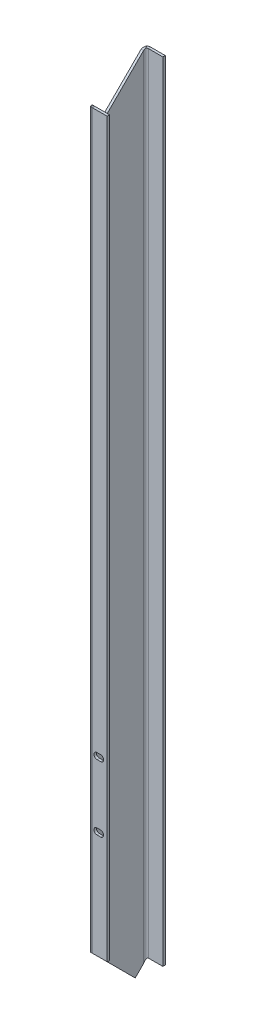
ISO-10303-21;
HEADER;
FILE_DESCRIPTION(('STEP AP214'),'2;1');
FILE_NAME('part.step','',(''),(''),'','','');
FILE_SCHEMA(('AUTOMOTIVE_DESIGN { 1 0 10303 214 1 1 1 1 }'));
ENDSEC;
DATA;
#1=APPLICATION_CONTEXT('core data for automotive mechanical design processes');
#2=APPLICATION_PROTOCOL_DEFINITION('international standard','automotive_design',2000,#1);
#3=PRODUCT_CONTEXT('',#1,'mechanical');
#4=PRODUCT('Part','Part','',(#3));
#5=PRODUCT_RELATED_PRODUCT_CATEGORY('part','',(#4));
#6=PRODUCT_DEFINITION_FORMATION('','',#4);
#7=PRODUCT_DEFINITION_CONTEXT('part definition',#1,'design');
#8=PRODUCT_DEFINITION('design','',#6,#7);
#9=PRODUCT_DEFINITION_SHAPE('','',#8);
#10=(LENGTH_UNIT() NAMED_UNIT(*) SI_UNIT(.MILLI.,.METRE.));
#11=(NAMED_UNIT(*) PLANE_ANGLE_UNIT() SI_UNIT($,.RADIAN.));
#12=(NAMED_UNIT(*) SI_UNIT($,.STERADIAN.) SOLID_ANGLE_UNIT());
#13=UNCERTAINTY_MEASURE_WITH_UNIT(LENGTH_MEASURE(1.E-05),#10,'distance_accuracy_value','');
#14=(GEOMETRIC_REPRESENTATION_CONTEXT(3) GLOBAL_UNCERTAINTY_ASSIGNED_CONTEXT((#13)) GLOBAL_UNIT_ASSIGNED_CONTEXT((#10,
#11,#12)) REPRESENTATION_CONTEXT('',''));
#15=CARTESIAN_POINT('',(0.,0.,0.));
#16=DIRECTION('',(0.,0.,1.));
#17=DIRECTION('',(1.,0.,0.));
#18=AXIS2_PLACEMENT_3D('',#15,#16,#17);
#19=CARTESIAN_POINT('',(0.,2120.9,0.));
#20=DIRECTION('',(-1.,0.,0.));
#21=DIRECTION('',(0.,0.,1.));
#22=AXIS2_PLACEMENT_3D('',#19,#20,#21);
#23=PLANE('',#22);
#24=DIRECTION('',(0.,0.707106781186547,-0.707106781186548));
#25=VECTOR('',#24,1.);
#26=CARTESIAN_POINT('',(0.,1.11022302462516E-13,-100.0125));
#27=LINE('',#26,#25);
#28=CARTESIAN_POINT('',(0.,17.9605122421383,-117.973012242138));
#29=VERTEX_POINT('',#28);
#30=CARTESIAN_POINT('',(-3.19744231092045E-11,39.6875,-139.699999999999));
#31=VERTEX_POINT('',#30);
#32=EDGE_CURVE('E287',#29,#31,#27,.T.);
#33=ORIENTED_EDGE('',*,*,#32,.F.);
#34=DIRECTION('',(0.,-0.707106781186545,-0.70710678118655));
#35=VECTOR('',#34,1.);
#36=CARTESIAN_POINT('',(0.,1128.41676224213,992.483237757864));
#37=LINE('',#36,#35);
#38=CARTESIAN_POINT('',(0.,123.233524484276,-12.699999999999));
#39=VERTEX_POINT('',#38);
#40=EDGE_CURVE('E57',#39,#29,#37,.T.);
#41=ORIENTED_EDGE('',*,*,#40,.F.);
#42=DIRECTION('',(0.,-1.,0.));
#43=VECTOR('',#42,1.);
#44=CARTESIAN_POINT('',(0.,2120.9,-12.6999999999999));
#45=LINE('',#44,#43);
#46=CARTESIAN_POINT('',(0.,2052.6375,-12.6999999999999));
#47=VERTEX_POINT('',#46);
#48=EDGE_CURVE('E246',#47,#39,#45,.T.);
#49=ORIENTED_EDGE('',*,*,#48,.F.);
#50=DIRECTION('',(0.,0.707106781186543,0.707106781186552));
#51=VECTOR('',#50,1.);
#52=CARTESIAN_POINT('',(0.,2020.8875,-44.4499999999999));
#53=LINE('',#52,#51);
#54=CARTESIAN_POINT('',(0.,2020.8875,-44.4499999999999));
#55=VERTEX_POINT('',#54);
#56=EDGE_CURVE('E321',#55,#47,#53,.T.);
#57=ORIENTED_EDGE('',*,*,#56,.F.);
#58=DIRECTION('',(0.,-0.707106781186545,0.70710678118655));
#59=VECTOR('',#58,1.);
#60=CARTESIAN_POINT('',(0.,2120.9,-144.4625));
#61=LINE('',#60,#59);
#62=CARTESIAN_POINT('',(0.,2116.1375,-139.699999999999));
#63=VERTEX_POINT('',#62);
#64=EDGE_CURVE('E316',#63,#55,#61,.T.);
#65=ORIENTED_EDGE('',*,*,#64,.F.);
#66=DIRECTION('',(0.,-1.,0.));
#67=VECTOR('',#66,1.);
#68=CARTESIAN_POINT('',(0.,2120.9,-139.7));
#69=LINE('',#68,#67);
#70=EDGE_CURVE('E249',#63,#31,#69,.T.);
#71=ORIENTED_EDGE('',*,*,#70,.T.);
#72=EDGE_LOOP('',(#33,#41,#49,#57,#65,#71));
#73=FACE_BOUND('',#72,.T.);
#74=ADVANCED_FACE('F42',(#73),#23,.T.);
#75=CARTESIAN_POINT('',(6.34999999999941,2120.9,0.));
#76=DIRECTION('',(-1.,0.,0.));
#77=DIRECTION('',(0.,0.,1.));
#78=AXIS2_PLACEMENT_3D('',#75,#76,#77);
#79=PLANE('',#78);
#80=DIRECTION('',(0.,-0.707106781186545,-0.70710678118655));
#81=VECTOR('',#80,1.);
#82=CARTESIAN_POINT('',(6.34999999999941,1128.41676224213,992.483237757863));
#83=LINE('',#82,#81);
#84=CARTESIAN_POINT('',(6.34999999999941,123.233524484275,-12.6999999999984));
#85=VERTEX_POINT('',#84);
#86=CARTESIAN_POINT('',(6.35000000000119,17.9605122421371,-117.973012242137));
#87=VERTEX_POINT('',#86);
#88=EDGE_CURVE('E198',#85,#87,#83,.T.);
#89=ORIENTED_EDGE('',*,*,#88,.T.);
#90=DIRECTION('',(0.,0.707106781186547,-0.707106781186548));
#91=VECTOR('',#90,1.);
#92=CARTESIAN_POINT('',(6.35000000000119,-1.33226762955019E-12,-100.012499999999));
#93=LINE('',#92,#91);
#94=CARTESIAN_POINT('',(6.34999999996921,39.6874999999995,-139.7));
#95=VERTEX_POINT('',#94);
#96=EDGE_CURVE('E289',#87,#95,#93,.T.);
#97=ORIENTED_EDGE('',*,*,#96,.T.);
#98=DIRECTION('',(0.,-1.,0.));
#99=VECTOR('',#98,1.);
#100=CARTESIAN_POINT('',(6.34999999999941,2120.9,-139.7));
#101=LINE('',#100,#99);
#102=CARTESIAN_POINT('',(6.34999999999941,2116.1375,-139.699999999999));
#103=VERTEX_POINT('',#102);
#104=EDGE_CURVE('E229',#103,#95,#101,.T.);
#105=ORIENTED_EDGE('',*,*,#104,.F.);
#106=DIRECTION('',(0.,-0.707106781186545,0.70710678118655));
#107=VECTOR('',#106,1.);
#108=CARTESIAN_POINT('',(6.34999999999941,2120.9,-144.4625));
#109=LINE('',#108,#107);
#110=CARTESIAN_POINT('',(6.34999999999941,2020.8875,-44.4499999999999));
#111=VERTEX_POINT('',#110);
#112=EDGE_CURVE('E319',#103,#111,#109,.T.);
#113=ORIENTED_EDGE('',*,*,#112,.T.);
#114=DIRECTION('',(0.,0.707106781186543,0.707106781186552));
#115=VECTOR('',#114,1.);
#116=CARTESIAN_POINT('',(6.34999999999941,2020.8875,-44.4499999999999));
#117=LINE('',#116,#115);
#118=CARTESIAN_POINT('',(6.34999999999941,2052.6375,-12.6999999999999));
#119=VERTEX_POINT('',#118);
#120=EDGE_CURVE('E228',#111,#119,#117,.T.);
#121=ORIENTED_EDGE('',*,*,#120,.T.);
#122=DIRECTION('',(0.,-1.,0.));
#123=VECTOR('',#122,1.);
#124=CARTESIAN_POINT('',(6.34999999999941,2120.9,-12.6999999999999));
#125=LINE('',#124,#123);
#126=EDGE_CURVE('E221',#119,#85,#125,.T.);
#127=ORIENTED_EDGE('',*,*,#126,.T.);
#128=EDGE_LOOP('',(#89,#97,#105,#113,#121,#127));
#129=FACE_BOUND('',#128,.T.);
#130=ADVANCED_FACE('F226',(#129),#79,.F.);
#131=CARTESIAN_POINT('',(12.7000000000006,2120.9,-12.6999999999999));
#132=DIRECTION('',(0.,-1.,0.));
#133=DIRECTION('',(0.,0.,-1.));
#134=AXIS2_PLACEMENT_3D('',#131,#132,#133);
#135=CYLINDRICAL_SURFACE('',#134,12.7);
#136=ORIENTED_EDGE('',*,*,#48,.T.);
#137=CARTESIAN_POINT('',(12.6999999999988,123.233524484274,-12.6999999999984));
#138=DIRECTION('',(0.,0.70710678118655,-0.707106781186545));
#139=DIRECTION('',(0.,-0.707106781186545,-0.70710678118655));
#140=AXIS2_PLACEMENT_3D('',#137,#138,#139);
#141=ELLIPSE('',#140,17.9605122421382,12.7);
#142=CARTESIAN_POINT('',(12.6999999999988,135.933524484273,1.77635683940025E-12));
#143=VERTEX_POINT('',#142);
#144=EDGE_CURVE('E214',#143,#39,#141,.F.);
#145=ORIENTED_EDGE('',*,*,#144,.F.);
#146=DIRECTION('',(0.,-1.,0.));
#147=VECTOR('',#146,1.);
#148=CARTESIAN_POINT('',(12.7000000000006,2120.9,0.));
#149=LINE('',#148,#147);
#150=CARTESIAN_POINT('',(12.6999999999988,2058.9875,0.));
#151=VERTEX_POINT('',#150);
#152=EDGE_CURVE('E243',#151,#143,#149,.T.);
#153=ORIENTED_EDGE('',*,*,#152,.F.);
#154=CARTESIAN_POINT('',(12.6999999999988,2052.6375,-12.6999999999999));
#155=DIRECTION('',(0.,-0.89442719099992,0.44721359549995));
#156=DIRECTION('',(0.,-0.44721359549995,-0.89442719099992));
#157=AXIS2_PLACEMENT_3D('',#154,#155,#156);
#158=ELLIPSE('',#157,14.1990316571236,12.7);
#159=EDGE_CURVE('E304',#47,#151,#158,.F.);
#160=ORIENTED_EDGE('',*,*,#159,.F.);
#161=EDGE_LOOP('',(#136,#145,#153,#160));
#162=FACE_BOUND('',#161,.T.);
#163=ADVANCED_FACE('F464',(#162),#135,.T.);
#164=CARTESIAN_POINT('',(50.8000000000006,2120.9,-2.22044604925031E-13));
#165=DIRECTION('',(0.,0.,1.));
#166=DIRECTION('',(1.,0.,0.));
#167=AXIS2_PLACEMENT_3D('',#164,#165,#166);
#168=PLANE('',#167);
#169=CARTESIAN_POINT('',(23.8125,419.099999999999,1.99840144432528E-12));
#170=DIRECTION('',(0.,0.,1.));
#171=DIRECTION('',(1.,0.,0.));
#172=AXIS2_PLACEMENT_3D('',#169,#170,#171);
#173=CIRCLE('',#172,7.93749999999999);
#174=CARTESIAN_POINT('',(23.8125,427.037499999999,2.22044604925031E-12));
#175=VERTEX_POINT('',#174);
#176=CARTESIAN_POINT('',(23.8125,411.162499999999,2.88657986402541E-12));
#177=VERTEX_POINT('',#176);
#178=EDGE_CURVE('E367',#175,#177,#173,.T.);
#179=ORIENTED_EDGE('',*,*,#178,.F.);
#180=DIRECTION('',(-1.,0.,0.));
#181=VECTOR('',#180,1.);
#182=CARTESIAN_POINT('',(23.8125,427.037499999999,2.22044604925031E-12));
#183=LINE('',#182,#181);
#184=CARTESIAN_POINT('',(33.3375,427.037499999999,2.66453525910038E-12));
#185=VERTEX_POINT('',#184);
#186=EDGE_CURVE('E386',#185,#175,#183,.T.);
#187=ORIENTED_EDGE('',*,*,#186,.F.);
#188=CARTESIAN_POINT('',(33.3375,419.099999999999,3.5527136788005E-12));
#189=DIRECTION('',(0.,0.,1.));
#190=DIRECTION('',(1.,0.,0.));
#191=AXIS2_PLACEMENT_3D('',#188,#189,#190);
#192=CIRCLE('',#191,7.93749999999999);
#193=CARTESIAN_POINT('',(33.3375,411.162499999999,2.44249065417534E-12));
#194=VERTEX_POINT('',#193);
#195=EDGE_CURVE('E383',#194,#185,#192,.T.);
#196=ORIENTED_EDGE('',*,*,#195,.F.);
#197=DIRECTION('',(1.,0.,0.));
#198=VECTOR('',#197,1.);
#199=CARTESIAN_POINT('',(23.8125,411.162499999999,1.77635683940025E-12));
#200=LINE('',#199,#198);
#201=EDGE_CURVE('E380',#177,#194,#200,.T.);
#202=ORIENTED_EDGE('',*,*,#201,.F.);
#203=EDGE_LOOP('',(#179,#187,#196,#202));
#204=FACE_BOUND('',#203,.T.);
#205=CARTESIAN_POINT('',(23.812499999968,590.549999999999,3.33066907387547E-12));
#206=DIRECTION('',(0.,0.,1.));
#207=DIRECTION('',(1.,0.,0.));
#208=AXIS2_PLACEMENT_3D('',#205,#206,#207);
#209=CIRCLE('',#208,7.93749999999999);
#210=CARTESIAN_POINT('',(23.8124999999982,598.487499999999,2.22044604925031E-12));
#211=VERTEX_POINT('',#210);
#212=CARTESIAN_POINT('',(23.812499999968,582.6125,8.88178419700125E-13));
#213=VERTEX_POINT('',#212);
#214=EDGE_CURVE('E65',#211,#213,#209,.T.);
#215=ORIENTED_EDGE('',*,*,#214,.F.);
#216=DIRECTION('',(-1.,0.,0.));
#217=VECTOR('',#216,1.);
#218=CARTESIAN_POINT('',(23.8124999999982,598.487499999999,2.22044604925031E-12));
#219=LINE('',#218,#217);
#220=CARTESIAN_POINT('',(33.3374999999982,598.487499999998,3.33066907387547E-12));
#221=VERTEX_POINT('',#220);
#222=EDGE_CURVE('E397',#221,#211,#219,.T.);
#223=ORIENTED_EDGE('',*,*,#222,.F.);
#224=CARTESIAN_POINT('',(33.337499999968,590.549999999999,2.44249065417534E-12));
#225=DIRECTION('',(0.,0.,1.));
#226=DIRECTION('',(1.,0.,0.));
#227=AXIS2_PLACEMENT_3D('',#224,#225,#226);
#228=CIRCLE('',#227,7.93749999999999);
#229=CARTESIAN_POINT('',(33.337499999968,582.612499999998,2.88657986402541E-12));
#230=VERTEX_POINT('',#229);
#231=EDGE_CURVE('E405',#230,#221,#228,.T.);
#232=ORIENTED_EDGE('',*,*,#231,.F.);
#233=DIRECTION('',(1.,0.,0.));
#234=VECTOR('',#233,1.);
#235=CARTESIAN_POINT('',(23.812499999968,582.6125,8.88178419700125E-13));
#236=LINE('',#235,#234);
#237=EDGE_CURVE('E414',#213,#230,#236,.T.);
#238=ORIENTED_EDGE('',*,*,#237,.F.);
#239=EDGE_LOOP('',(#215,#223,#232,#238));
#240=FACE_BOUND('',#239,.T.);
#241=ORIENTED_EDGE('',*,*,#152,.T.);
#242=DIRECTION('',(-1.,0.,0.));
#243=VECTOR('',#242,1.);
#244=CARTESIAN_POINT('',(50.7999999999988,135.933524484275,-2.22044604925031E-13));
#245=LINE('',#244,#243);
#246=CARTESIAN_POINT('',(50.7999999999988,135.933524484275,-2.22044604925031E-13));
#247=VERTEX_POINT('',#246);
#248=EDGE_CURVE('E424',#247,#143,#245,.T.);
#249=ORIENTED_EDGE('',*,*,#248,.F.);
#250=DIRECTION('',(0.,-1.,0.));
#251=VECTOR('',#250,1.);
#252=CARTESIAN_POINT('',(50.8000000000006,2120.9,-2.22044604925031E-13));
#253=LINE('',#252,#251);
#254=CARTESIAN_POINT('',(50.7999999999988,2058.9875,-2.22044604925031E-13));
#255=VERTEX_POINT('',#254);
#256=EDGE_CURVE('E240',#255,#247,#253,.T.);
#257=ORIENTED_EDGE('',*,*,#256,.F.);
#258=DIRECTION('',(1.,0.,0.));
#259=VECTOR('',#258,1.);
#260=CARTESIAN_POINT('',(50.7999999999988,2058.9875,-2.22044604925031E-13));
#261=LINE('',#260,#259);
#262=EDGE_CURVE('E308',#151,#255,#261,.T.);
#263=ORIENTED_EDGE('',*,*,#262,.F.);
#264=EDGE_LOOP('',(#241,#249,#257,#263));
#265=FACE_BOUND('',#264,.T.);
#266=ADVANCED_FACE('F535',(#204,#240,#265),#168,.T.);
#267=CARTESIAN_POINT('',(50.8000000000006,2120.9,-6.34999999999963));
#268=DIRECTION('',(1.,0.,0.));
#269=DIRECTION('',(0.,0.,-1.));
#270=AXIS2_PLACEMENT_3D('',#267,#268,#269);
#271=PLANE('',#270);
#272=ORIENTED_EDGE('',*,*,#256,.T.);
#273=DIRECTION('',(0.,0.,1.));
#274=VECTOR('',#273,1.);
#275=CARTESIAN_POINT('',(50.7999999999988,135.933524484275,-2.22044604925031E-13));
#276=LINE('',#275,#274);
#277=CARTESIAN_POINT('',(50.7999999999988,135.933524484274,-6.34999999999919));
#278=VERTEX_POINT('',#277);
#279=EDGE_CURVE('E419',#247,#278,#276,.F.);
#280=ORIENTED_EDGE('',*,*,#279,.T.);
#281=DIRECTION('',(0.,-1.,0.));
#282=VECTOR('',#281,1.);
#283=CARTESIAN_POINT('',(50.8000000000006,2120.9,-6.34999999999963));
#284=LINE('',#283,#282);
#285=CARTESIAN_POINT('',(50.7999999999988,2058.9875,-6.3500000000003));
#286=VERTEX_POINT('',#285);
#287=EDGE_CURVE('E231',#286,#278,#284,.T.);
#288=ORIENTED_EDGE('',*,*,#287,.F.);
#289=DIRECTION('',(0.,0.,-1.));
#290=VECTOR('',#289,1.);
#291=CARTESIAN_POINT('',(50.7999999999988,2058.9875,-6.3500000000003));
#292=LINE('',#291,#290);
#293=EDGE_CURVE('E313',#286,#255,#292,.F.);
#294=ORIENTED_EDGE('',*,*,#293,.T.);
#295=EDGE_LOOP('',(#272,#280,#288,#294));
#296=FACE_BOUND('',#295,.T.);
#297=ADVANCED_FACE('F527',(#296),#271,.T.);
#298=CARTESIAN_POINT('',(50.8000000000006,2120.9,-6.34999999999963));
#299=DIRECTION('',(0.,0.,1.));
#300=DIRECTION('',(1.,0.,0.));
#301=AXIS2_PLACEMENT_3D('',#298,#299,#300);
#302=PLANE('',#301);
#303=DIRECTION('',(1.,0.,0.));
#304=VECTOR('',#303,1.);
#305=CARTESIAN_POINT('',(23.8125,427.0375,-6.34999999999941));
#306=LINE('',#305,#304);
#307=CARTESIAN_POINT('',(23.8125,427.0375,-6.34999999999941));
#308=VERTEX_POINT('',#307);
#309=CARTESIAN_POINT('',(33.3375,427.037499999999,-6.34999999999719));
#310=VERTEX_POINT('',#309);
#311=EDGE_CURVE('E372',#308,#310,#306,.T.);
#312=ORIENTED_EDGE('',*,*,#311,.F.);
#313=CARTESIAN_POINT('',(23.8125,419.099999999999,-6.34999999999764));
#314=DIRECTION('',(0.,0.,1.));
#315=DIRECTION('',(1.,0.,0.));
#316=AXIS2_PLACEMENT_3D('',#313,#314,#315);
#317=CIRCLE('',#316,7.93749999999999);
#318=CARTESIAN_POINT('',(23.8125,411.162499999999,-6.34999999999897));
#319=VERTEX_POINT('',#318);
#320=EDGE_CURVE('E375',#319,#308,#317,.F.);
#321=ORIENTED_EDGE('',*,*,#320,.F.);
#322=DIRECTION('',(-1.,0.,0.));
#323=VECTOR('',#322,1.);
#324=CARTESIAN_POINT('',(23.8125,411.162499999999,-6.34999999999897));
#325=LINE('',#324,#323);
#326=CARTESIAN_POINT('',(33.3375,411.162499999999,-6.34999999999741));
#327=VERTEX_POINT('',#326);
#328=EDGE_CURVE('E378',#327,#319,#325,.T.);
#329=ORIENTED_EDGE('',*,*,#328,.F.);
#330=CARTESIAN_POINT('',(33.3375,419.099999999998,-6.34999999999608));
#331=DIRECTION('',(0.,0.,1.));
#332=DIRECTION('',(1.,0.,0.));
#333=AXIS2_PLACEMENT_3D('',#330,#331,#332);
#334=CIRCLE('',#333,7.93749999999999);
#335=EDGE_CURVE('E359',#310,#327,#334,.F.);
#336=ORIENTED_EDGE('',*,*,#335,.F.);
#337=EDGE_LOOP('',(#312,#321,#329,#336));
#338=FACE_BOUND('',#337,.T.);
#339=DIRECTION('',(1.,0.,0.));
#340=VECTOR('',#339,1.);
#341=CARTESIAN_POINT('',(23.8125,598.487499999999,-6.34999999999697));
#342=LINE('',#341,#340);
#343=CARTESIAN_POINT('',(23.8125,598.487499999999,-6.34999999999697));
#344=VERTEX_POINT('',#343);
#345=CARTESIAN_POINT('',(33.3375,598.487499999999,-6.34999999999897));
#346=VERTEX_POINT('',#345);
#347=EDGE_CURVE('E399',#344,#346,#342,.T.);
#348=ORIENTED_EDGE('',*,*,#347,.F.);
#349=CARTESIAN_POINT('',(23.812499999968,590.549999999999,-6.34999999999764));
#350=DIRECTION('',(0.,0.,1.));
#351=DIRECTION('',(1.,0.,0.));
#352=AXIS2_PLACEMENT_3D('',#349,#350,#351);
#353=CIRCLE('',#352,7.93749999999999);
#354=CARTESIAN_POINT('',(23.812499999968,582.612499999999,-6.34999999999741));
#355=VERTEX_POINT('',#354);
#356=EDGE_CURVE('E392',#355,#344,#353,.F.);
#357=ORIENTED_EDGE('',*,*,#356,.F.);
#358=DIRECTION('',(-1.,0.,0.));
#359=VECTOR('',#358,1.);
#360=CARTESIAN_POINT('',(23.812499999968,582.612499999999,-6.34999999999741));
#361=LINE('',#360,#359);
#362=CARTESIAN_POINT('',(33.337499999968,582.612499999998,-6.34999999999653));
#363=VERTEX_POINT('',#362);
#364=EDGE_CURVE('E416',#363,#355,#361,.T.);
#365=ORIENTED_EDGE('',*,*,#364,.F.);
#366=CARTESIAN_POINT('',(33.337499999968,590.549999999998,-6.34999999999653));
#367=DIRECTION('',(0.,0.,1.));
#368=DIRECTION('',(1.,0.,0.));
#369=AXIS2_PLACEMENT_3D('',#366,#367,#368);
#370=CIRCLE('',#369,7.93749999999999);
#371=EDGE_CURVE('E407',#346,#363,#370,.F.);
#372=ORIENTED_EDGE('',*,*,#371,.F.);
#373=EDGE_LOOP('',(#348,#357,#365,#372));
#374=FACE_BOUND('',#373,.T.);
#375=DIRECTION('',(1.,0.,0.));
#376=VECTOR('',#375,1.);
#377=CARTESIAN_POINT('',(50.7999999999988,135.933524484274,-6.34999999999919));
#378=LINE('',#377,#376);
#379=CARTESIAN_POINT('',(12.6999999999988,135.933524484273,-6.34999999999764));
#380=VERTEX_POINT('',#379);
#381=EDGE_CURVE('E422',#278,#380,#378,.F.);
#382=ORIENTED_EDGE('',*,*,#381,.T.);
#383=DIRECTION('',(0.,-1.,0.));
#384=VECTOR('',#383,1.);
#385=CARTESIAN_POINT('',(12.7000000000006,2120.9,-6.34999999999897));
#386=LINE('',#385,#384);
#387=CARTESIAN_POINT('',(12.6999999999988,2058.9875,-6.34999999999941));
#388=VERTEX_POINT('',#387);
#389=EDGE_CURVE('E223',#388,#380,#386,.T.);
#390=ORIENTED_EDGE('',*,*,#389,.F.);
#391=DIRECTION('',(1.,0.,0.));
#392=VECTOR('',#391,1.);
#393=CARTESIAN_POINT('',(50.7999999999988,2058.9875,-6.3500000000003));
#394=LINE('',#393,#392);
#395=EDGE_CURVE('E306',#388,#286,#394,.T.);
#396=ORIENTED_EDGE('',*,*,#395,.T.);
#397=ORIENTED_EDGE('',*,*,#287,.T.);
#398=EDGE_LOOP('',(#382,#390,#396,#397));
#399=FACE_BOUND('',#398,.T.);
#400=ADVANCED_FACE('F520',(#338,#374,#399),#302,.F.);
#401=CARTESIAN_POINT('',(12.7000000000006,2120.9,-12.6999999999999));
#402=DIRECTION('',(0.,-1.,0.));
#403=DIRECTION('',(0.,0.,-1.));
#404=AXIS2_PLACEMENT_3D('',#401,#402,#403);
#405=CYLINDRICAL_SURFACE('',#404,6.35);
#406=CARTESIAN_POINT('',(12.6999999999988,123.233524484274,-12.6999999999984));
#407=DIRECTION('',(0.,0.44721359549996,-0.894427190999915));
#408=DIRECTION('',(0.,-0.894427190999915,-0.44721359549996));
#409=AXIS2_PLACEMENT_3D('',#406,#407,#408);
#410=ELLIPSE('',#409,14.1990316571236,6.35);
#411=EDGE_CURVE('E206',#380,#85,#410,.F.);
#412=ORIENTED_EDGE('',*,*,#411,.T.);
#413=ORIENTED_EDGE('',*,*,#126,.F.);
#414=CARTESIAN_POINT('',(12.6999999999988,2052.6375,-12.6999999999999));
#415=DIRECTION('',(0.,-0.707106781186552,0.707106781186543));
#416=DIRECTION('',(0.,-0.707106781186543,-0.707106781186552));
#417=AXIS2_PLACEMENT_3D('',#414,#415,#416);
#418=ELLIPSE('',#417,8.9802561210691,6.35);
#419=EDGE_CURVE('E303',#119,#388,#418,.F.);
#420=ORIENTED_EDGE('',*,*,#419,.T.);
#421=ORIENTED_EDGE('',*,*,#389,.T.);
#422=EDGE_LOOP('',(#412,#413,#420,#421));
#423=FACE_BOUND('',#422,.T.);
#424=ADVANCED_FACE('F219',(#423),#405,.F.);
#425=CARTESIAN_POINT('',(0.,1.11022302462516E-13,-100.0125));
#426=DIRECTION('',(0.,0.707106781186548,0.707106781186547));
#427=DIRECTION('',(0.,0.707106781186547,-0.707106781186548));
#428=AXIS2_PLACEMENT_3D('',#425,#426,#427);
#429=PLANE('',#428);
#430=ORIENTED_EDGE('',*,*,#96,.F.);
#431=DIRECTION('',(1.,0.,0.));
#432=VECTOR('',#431,1.);
#433=CARTESIAN_POINT('',(6.35000000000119,17.9605122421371,-117.973012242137));
#434=LINE('',#433,#432);
#435=EDGE_CURVE('E202',#87,#29,#434,.F.);
#436=ORIENTED_EDGE('',*,*,#435,.T.);
#437=ORIENTED_EDGE('',*,*,#32,.T.);
#438=DIRECTION('',(-1.,0.,0.));
#439=VECTOR('',#438,1.);
#440=CARTESIAN_POINT('',(-3.19744231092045E-11,39.6875,-139.699999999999));
#441=LINE('',#440,#439);
#442=EDGE_CURVE('E291',#31,#95,#441,.F.);
#443=ORIENTED_EDGE('',*,*,#442,.T.);
#444=EDGE_LOOP('',(#430,#436,#437,#443));
#445=FACE_BOUND('',#444,.T.);
#446=ADVANCED_FACE('F432',(#445),#429,.F.);
#447=CARTESIAN_POINT('',(12.7000000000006,2120.9,-139.7));
#448=DIRECTION('',(0.,-1.,0.));
#449=DIRECTION('',(0.,0.,-1.));
#450=AXIS2_PLACEMENT_3D('',#447,#448,#449);
#451=CYLINDRICAL_SURFACE('',#450,12.7);
#452=DIRECTION('',(0.,-1.,0.));
#453=VECTOR('',#452,1.);
#454=CARTESIAN_POINT('',(12.7000000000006,2120.9,-152.4));
#455=LINE('',#454,#453);
#456=CARTESIAN_POINT('',(12.7000000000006,2120.9,-152.4));
#457=VERTEX_POINT('',#456);
#458=CARTESIAN_POINT('',(12.6999999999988,52.3874999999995,-152.4));
#459=VERTEX_POINT('',#458);
#460=EDGE_CURVE('E252',#457,#459,#455,.T.);
#461=ORIENTED_EDGE('',*,*,#460,.T.);
#462=CARTESIAN_POINT('',(12.6999999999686,39.6874999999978,-139.699999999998));
#463=DIRECTION('',(0.,-0.707106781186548,-0.707106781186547));
#464=DIRECTION('',(0.,-0.707106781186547,0.707106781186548));
#465=AXIS2_PLACEMENT_3D('',#462,#463,#464);
#466=ELLIPSE('',#465,17.9605122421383,12.7);
#467=EDGE_CURVE('E284',#459,#31,#466,.F.);
#468=ORIENTED_EDGE('',*,*,#467,.T.);
#469=ORIENTED_EDGE('',*,*,#70,.F.);
#470=CARTESIAN_POINT('',(12.7000000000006,2116.1375,-139.699999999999));
#471=DIRECTION('',(0.,-0.89442719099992,-0.44721359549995));
#472=DIRECTION('',(0.,-0.44721359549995,0.89442719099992));
#473=AXIS2_PLACEMENT_3D('',#470,#471,#472);
#474=ELLIPSE('',#473,14.1990316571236,12.7);
#475=CARTESIAN_POINT('',(4.29973958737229,2120.9,-149.225000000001));
#476=VERTEX_POINT('',#475);
#477=EDGE_CURVE('E296',#476,#63,#474,.F.);
#478=ORIENTED_EDGE('',*,*,#477,.F.);
#479=CARTESIAN_POINT('',(12.7000000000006,2120.9,-139.7));
#480=DIRECTION('',(0.,1.,0.));
#481=DIRECTION('',(0.,0.,1.));
#482=AXIS2_PLACEMENT_3D('',#479,#480,#481);
#483=CIRCLE('',#482,12.7);
#484=EDGE_CURVE('E339',#476,#457,#483,.F.);
#485=ORIENTED_EDGE('',*,*,#484,.T.);
#486=EDGE_LOOP('',(#461,#468,#469,#478,#485));
#487=FACE_BOUND('',#486,.T.);
#488=ADVANCED_FACE('F440',(#487),#451,.T.);
#489=CARTESIAN_POINT('',(12.7000000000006,2120.9,-139.7));
#490=DIRECTION('',(0.,-1.,0.));
#491=DIRECTION('',(0.,0.,-1.));
#492=AXIS2_PLACEMENT_3D('',#489,#490,#491);
#493=CYLINDRICAL_SURFACE('',#492,6.35);
#494=CARTESIAN_POINT('',(12.6999999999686,39.6874999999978,-139.699999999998));
#495=DIRECTION('',(0.,-0.447213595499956,-0.894427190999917));
#496=DIRECTION('',(0.,-0.894427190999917,0.447213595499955));
#497=AXIS2_PLACEMENT_3D('',#494,#495,#496);
#498=ELLIPSE('',#497,14.1990316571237,6.35);
#499=CARTESIAN_POINT('',(12.6999999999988,52.3874999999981,-146.049999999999));
#500=VERTEX_POINT('',#499);
#501=EDGE_CURVE('E281',#500,#95,#498,.F.);
#502=ORIENTED_EDGE('',*,*,#501,.F.);
#503=DIRECTION('',(0.,-1.,0.));
#504=VECTOR('',#503,1.);
#505=CARTESIAN_POINT('',(12.7000000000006,2120.9,-146.049999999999));
#506=LINE('',#505,#504);
#507=CARTESIAN_POINT('',(12.7000000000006,2120.9,-146.049999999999));
#508=VERTEX_POINT('',#507);
#509=EDGE_CURVE('E234',#508,#500,#506,.T.);
#510=ORIENTED_EDGE('',*,*,#509,.F.);
#511=CARTESIAN_POINT('',(12.7000000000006,2120.9,-139.7));
#512=DIRECTION('',(0.,1.,0.));
#513=DIRECTION('',(1.,0.,0.));
#514=AXIS2_PLACEMENT_3D('',#511,#512,#513);
#515=CIRCLE('',#514,6.35);
#516=CARTESIAN_POINT('',(8.49986979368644,2120.9,-144.4625));
#517=VERTEX_POINT('',#516);
#518=EDGE_CURVE('E341',#517,#508,#515,.F.);
#519=ORIENTED_EDGE('',*,*,#518,.F.);
#520=CARTESIAN_POINT('',(12.7000000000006,2116.1375,-139.699999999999));
#521=DIRECTION('',(0.,-0.70710678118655,-0.707106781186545));
#522=DIRECTION('',(0.,-0.707106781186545,0.70710678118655));
#523=AXIS2_PLACEMENT_3D('',#520,#521,#522);
#524=ELLIPSE('',#523,8.98025612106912,6.35);
#525=EDGE_CURVE('E295',#517,#103,#524,.F.);
#526=ORIENTED_EDGE('',*,*,#525,.T.);
#527=ORIENTED_EDGE('',*,*,#104,.T.);
#528=EDGE_LOOP('',(#502,#510,#519,#526,#527));
#529=FACE_BOUND('',#528,.T.);
#530=ADVANCED_FACE('F353',(#529),#493,.F.);
#531=CARTESIAN_POINT('',(0.,2120.9,-146.049999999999));
#532=DIRECTION('',(0.,0.,-1.));
#533=DIRECTION('',(-1.,0.,0.));
#534=AXIS2_PLACEMENT_3D('',#531,#532,#533);
#535=PLANE('',#534);
#536=DIRECTION('',(-1.,0.,0.));
#537=VECTOR('',#536,1.);
#538=CARTESIAN_POINT('',(0.,52.3874999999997,-146.05));
#539=LINE('',#538,#537);
#540=CARTESIAN_POINT('',(50.7999999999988,52.3874999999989,-146.049999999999));
#541=VERTEX_POINT('',#540);
#542=EDGE_CURVE('E272',#541,#500,#539,.T.);
#543=ORIENTED_EDGE('',*,*,#542,.F.);
#544=DIRECTION('',(0.,-1.,0.));
#545=VECTOR('',#544,1.);
#546=CARTESIAN_POINT('',(50.8000000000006,2120.9,-146.05));
#547=LINE('',#546,#545);
#548=CARTESIAN_POINT('',(50.8000000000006,2120.9,-146.05));
#549=VERTEX_POINT('',#548);
#550=EDGE_CURVE('E50',#549,#541,#547,.T.);
#551=ORIENTED_EDGE('',*,*,#550,.F.);
#552=DIRECTION('',(1.,0.,0.));
#553=VECTOR('',#552,1.);
#554=CARTESIAN_POINT('',(0.,2120.9,-146.049999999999));
#555=LINE('',#554,#553);
#556=EDGE_CURVE('E271',#508,#549,#555,.T.);
#557=ORIENTED_EDGE('',*,*,#556,.F.);
#558=ORIENTED_EDGE('',*,*,#509,.T.);
#559=EDGE_LOOP('',(#543,#551,#557,#558));
#560=FACE_BOUND('',#559,.T.);
#561=ADVANCED_FACE('F269',(#560),#535,.F.);
#562=CARTESIAN_POINT('',(50.8000000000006,2120.9,-152.4));
#563=DIRECTION('',(1.,0.,0.));
#564=DIRECTION('',(0.,0.,-1.));
#565=AXIS2_PLACEMENT_3D('',#562,#563,#564);
#566=PLANE('',#565);
#567=ORIENTED_EDGE('',*,*,#550,.T.);
#568=DIRECTION('',(0.,0.,-1.));
#569=VECTOR('',#568,1.);
#570=CARTESIAN_POINT('',(50.7999999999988,52.3875,-152.4));
#571=LINE('',#570,#569);
#572=CARTESIAN_POINT('',(50.7999999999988,52.3875,-152.4));
#573=VERTEX_POINT('',#572);
#574=EDGE_CURVE('E263',#573,#541,#571,.F.);
#575=ORIENTED_EDGE('',*,*,#574,.F.);
#576=DIRECTION('',(0.,-1.,0.));
#577=VECTOR('',#576,1.);
#578=CARTESIAN_POINT('',(50.8000000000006,2120.9,-152.4));
#579=LINE('',#578,#577);
#580=CARTESIAN_POINT('',(50.8000000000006,2120.9,-152.4));
#581=VERTEX_POINT('',#580);
#582=EDGE_CURVE('E255',#581,#573,#579,.T.);
#583=ORIENTED_EDGE('',*,*,#582,.F.);
#584=DIRECTION('',(0.,0.,1.));
#585=VECTOR('',#584,1.);
#586=CARTESIAN_POINT('',(50.8000000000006,2120.9,-152.4));
#587=LINE('',#586,#585);
#588=EDGE_CURVE('E265',#581,#549,#587,.T.);
#589=ORIENTED_EDGE('',*,*,#588,.T.);
#590=EDGE_LOOP('',(#567,#575,#583,#589));
#591=FACE_BOUND('',#590,.T.);
#592=ADVANCED_FACE('F262',(#591),#566,.T.);
#593=CARTESIAN_POINT('',(0.,2120.9,-152.4));
#594=DIRECTION('',(0.,0.,-1.));
#595=DIRECTION('',(-1.,0.,0.));
#596=AXIS2_PLACEMENT_3D('',#593,#594,#595);
#597=PLANE('',#596);
#598=ORIENTED_EDGE('',*,*,#582,.T.);
#599=DIRECTION('',(-1.,0.,0.));
#600=VECTOR('',#599,1.);
#601=CARTESIAN_POINT('',(0.,52.3874999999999,-152.399999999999));
#602=LINE('',#601,#600);
#603=EDGE_CURVE('E276',#573,#459,#602,.T.);
#604=ORIENTED_EDGE('',*,*,#603,.T.);
#605=ORIENTED_EDGE('',*,*,#460,.F.);
#606=DIRECTION('',(1.,0.,0.));
#607=VECTOR('',#606,1.);
#608=CARTESIAN_POINT('',(0.,2120.9,-152.4));
#609=LINE('',#608,#607);
#610=EDGE_CURVE('E336',#457,#581,#609,.T.);
#611=ORIENTED_EDGE('',*,*,#610,.T.);
#612=EDGE_LOOP('',(#598,#604,#605,#611));
#613=FACE_BOUND('',#612,.T.);
#614=ADVANCED_FACE('F444',(#613),#597,.T.);
#615=CARTESIAN_POINT('',(12.7000000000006,2120.9,-152.4));
#616=DIRECTION('',(0.,1.,0.));
#617=DIRECTION('',(0.,0.,1.));
#618=AXIS2_PLACEMENT_3D('',#615,#616,#617);
#619=PLANE('',#618);
#620=ORIENTED_EDGE('',*,*,#484,.F.);
#621=DIRECTION('',(0.661437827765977,0.,0.750000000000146));
#622=VECTOR('',#621,1.);
#623=CARTESIAN_POINT('',(8.49986979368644,2120.9,-144.4625));
#624=LINE('',#623,#622);
#625=EDGE_CURVE('E299',#517,#476,#624,.F.);
#626=ORIENTED_EDGE('',*,*,#625,.F.);
#627=ORIENTED_EDGE('',*,*,#518,.T.);
#628=DIRECTION('',(0.,0.,1.));
#629=VECTOR('',#628,1.);
#630=CARTESIAN_POINT('',(12.7000000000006,2120.9,-152.4));
#631=LINE('',#630,#629);
#632=EDGE_CURVE('E11',#457,#508,#631,.T.);
#633=ORIENTED_EDGE('',*,*,#632,.F.);
#634=EDGE_LOOP('',(#620,#626,#627,#633));
#635=FACE_BOUND('',#634,.T.);
#636=ADVANCED_FACE('F44',(#635),#619,.T.);
#637=CARTESIAN_POINT('',(6.34999999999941,2120.9,-139.7));
#638=DIRECTION('',(0.,1.,0.));
#639=DIRECTION('',(0.,0.,1.));
#640=AXIS2_PLACEMENT_3D('',#637,#638,#639);
#641=PLANE('',#640);
#642=ORIENTED_EDGE('',*,*,#610,.F.);
#643=ORIENTED_EDGE('',*,*,#632,.T.);
#644=ORIENTED_EDGE('',*,*,#556,.T.);
#645=ORIENTED_EDGE('',*,*,#588,.F.);
#646=EDGE_LOOP('',(#642,#643,#644,#645));
#647=FACE_BOUND('',#646,.T.);
#648=ADVANCED_FACE('F351',(#647),#641,.T.);
#649=CARTESIAN_POINT('',(0.,2120.9,-144.4625));
#650=DIRECTION('',(0.,-0.70710678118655,-0.707106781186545));
#651=DIRECTION('',(0.,-0.707106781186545,0.70710678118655));
#652=AXIS2_PLACEMENT_3D('',#649,#650,#651);
#653=PLANE('',#652);
#654=DIRECTION('',(-1.,0.,0.));
#655=VECTOR('',#654,1.);
#656=CARTESIAN_POINT('',(0.,2116.1375,-139.699999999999));
#657=LINE('',#656,#655);
#658=EDGE_CURVE('E327',#63,#103,#657,.F.);
#659=ORIENTED_EDGE('',*,*,#658,.F.);
#660=ORIENTED_EDGE('',*,*,#64,.T.);
#661=DIRECTION('',(-1.,0.,0.));
#662=VECTOR('',#661,1.);
#663=CARTESIAN_POINT('',(0.,2020.8875,-44.4499999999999));
#664=LINE('',#663,#662);
#665=EDGE_CURVE('E323',#55,#111,#664,.F.);
#666=ORIENTED_EDGE('',*,*,#665,.T.);
#667=ORIENTED_EDGE('',*,*,#112,.F.);
#668=EDGE_LOOP('',(#659,#660,#666,#667));
#669=FACE_BOUND('',#668,.T.);
#670=ADVANCED_FACE('F477',(#669),#653,.F.);
#671=CARTESIAN_POINT('',(0.,2020.8875,-44.4499999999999));
#672=DIRECTION('',(0.,-0.707106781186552,0.707106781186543));
#673=DIRECTION('',(0.,0.707106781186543,0.707106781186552));
#674=AXIS2_PLACEMENT_3D('',#671,#672,#673);
#675=PLANE('',#674);
#676=ORIENTED_EDGE('',*,*,#56,.T.);
#677=DIRECTION('',(-1.,0.,0.));
#678=VECTOR('',#677,1.);
#679=CARTESIAN_POINT('',(0.,2052.6375,-12.6999999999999));
#680=LINE('',#679,#678);
#681=EDGE_CURVE('E329',#47,#119,#680,.F.);
#682=ORIENTED_EDGE('',*,*,#681,.T.);
#683=ORIENTED_EDGE('',*,*,#120,.F.);
#684=ORIENTED_EDGE('',*,*,#665,.F.);
#685=EDGE_LOOP('',(#676,#682,#683,#684));
#686=FACE_BOUND('',#685,.T.);
#687=ADVANCED_FACE('F482',(#686),#675,.F.);
#688=CARTESIAN_POINT('',(50.7999999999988,2058.9875,-6.3500000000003));
#689=DIRECTION('',(0.,-1.,0.));
#690=DIRECTION('',(1.,0.,0.));
#691=AXIS2_PLACEMENT_3D('',#688,#689,#690);
#692=PLANE('',#691);
#693=ORIENTED_EDGE('',*,*,#293,.F.);
#694=ORIENTED_EDGE('',*,*,#395,.F.);
#695=DIRECTION('',(0.,0.,-1.));
#696=VECTOR('',#695,1.);
#697=CARTESIAN_POINT('',(12.6999999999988,2058.9875,-6.34999999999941));
#698=LINE('',#697,#696);
#699=EDGE_CURVE('E310',#388,#151,#698,.F.);
#700=ORIENTED_EDGE('',*,*,#699,.T.);
#701=ORIENTED_EDGE('',*,*,#262,.T.);
#702=EDGE_LOOP('',(#693,#694,#700,#701));
#703=FACE_BOUND('',#702,.T.);
#704=ADVANCED_FACE('F684',(#703),#692,.F.);
#705=CARTESIAN_POINT('',(12.6999999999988,2046.2875,-25.3999999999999));
#706=CARTESIAN_POINT('',(12.6999999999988,2046.2875,-23.2833333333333));
#707=CARTESIAN_POINT('',(12.6999999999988,2046.2875,-21.1666666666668));
#708=CARTESIAN_POINT('',(12.6999999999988,2046.2875,-19.0499999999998));
#709=CARTESIAN_POINT('',(-12.7000000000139,2046.2875,-25.3999999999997));
#710=CARTESIAN_POINT('',(-8.46666666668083,2046.2875,-23.2833333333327));
#711=CARTESIAN_POINT('',(-4.23333333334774,2046.2875,-21.1666666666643));
#712=CARTESIAN_POINT('',(-1.46549439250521E-11,2046.2875,-19.0499999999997));
#713=CARTESIAN_POINT('',(-12.7000000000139,2058.9875,1.66533453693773E-13));
#714=CARTESIAN_POINT('',(-8.46666666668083,2058.9875,-2.11666666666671));
#715=CARTESIAN_POINT('',(-4.23333333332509,2058.9875,-4.23333333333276));
#716=CARTESIAN_POINT('',(9.32587340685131E-12,2058.9875,-6.34999999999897));
#717=CARTESIAN_POINT('',(12.6999999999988,2058.9875,0.));
#718=CARTESIAN_POINT('',(12.6999999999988,2058.9875,-2.11666666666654));
#719=CARTESIAN_POINT('',(12.6999999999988,2058.9875,-4.23333333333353));
#720=CARTESIAN_POINT('',(12.6999999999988,2058.9875,-6.34999999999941));
#721=CARTESIAN_POINT('',(38.0999999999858,2058.9875,3.33066907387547E-13));
#722=CARTESIAN_POINT('',(33.8666666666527,2058.9875,-2.11666666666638));
#723=CARTESIAN_POINT('',(29.6333333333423,2058.9875,-4.23333333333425));
#724=CARTESIAN_POINT('',(25.4000000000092,2058.9875,-6.3500000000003));
#725=CARTESIAN_POINT('',(38.0999999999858,2046.2875,-25.3999999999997));
#726=CARTESIAN_POINT('',(33.8666666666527,2046.2875,-23.2833333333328));
#727=CARTESIAN_POINT('',(29.6333333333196,2046.2875,-21.1666666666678));
#728=CARTESIAN_POINT('',(25.3999999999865,2046.2875,-19.0499999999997));
#729=CARTESIAN_POINT('',(12.6999999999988,2046.2875,-25.3999999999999));
#730=CARTESIAN_POINT('',(12.6999999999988,2046.2875,-23.2833333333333));
#731=CARTESIAN_POINT('',(12.6999999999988,2046.2875,-21.1666666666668));
#732=CARTESIAN_POINT('',(12.6999999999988,2046.2875,-19.0499999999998));
#733=(BOUNDED_SURFACE() B_SPLINE_SURFACE(3,3,((#705,#706,#707,#708),(#709,#710,#711,#712),(#713,
#714,#715,#716),(#717,#718,#719,#720),(#721,#722,#723,#724),(#725,#726,#727,#728),(#729,#730,
#731,#732)),.UNSPECIFIED.,.T.,.F.,.F.) B_SPLINE_SURFACE_WITH_KNOTS((4,3,4),(4,4),(0.,0.5,1.),
(0.,1.),.UNSPECIFIED.) GEOMETRIC_REPRESENTATION_ITEM() RATIONAL_B_SPLINE_SURFACE(((1.,1.,1.,1.),
(0.333333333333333,0.333333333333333,0.333333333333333,0.333333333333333),(0.333333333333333,
0.333333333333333,0.333333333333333,0.333333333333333),(1.,1.,1.,1.),(0.333333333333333,
0.333333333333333,0.333333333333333,0.333333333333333),(0.333333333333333,0.333333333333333,
0.333333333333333,0.333333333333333),(1.,1.,1.,1.))) REPRESENTATION_ITEM('') SURFACE());
#734=ORIENTED_EDGE('',*,*,#699,.F.);
#735=ORIENTED_EDGE('',*,*,#419,.F.);
#736=ORIENTED_EDGE('',*,*,#681,.F.);
#737=ORIENTED_EDGE('',*,*,#159,.T.);
#738=EDGE_LOOP('',(#734,#735,#736,#737));
#739=FACE_BOUND('',#738,.T.);
#740=ADVANCED_FACE('F455',(#739),#733,.T.);
#741=CARTESIAN_POINT('',(12.7000000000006,2109.7875,-127.));
#742=CARTESIAN_POINT('',(12.7000000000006,2109.7875,-129.116666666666));
#743=CARTESIAN_POINT('',(12.7000000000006,2109.7875,-131.233333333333));
#744=CARTESIAN_POINT('',(12.7000000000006,2109.7875,-133.349999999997));
#745=CARTESIAN_POINT('',(38.0999999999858,2109.7875,-126.999999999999));
#746=CARTESIAN_POINT('',(33.8666666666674,2109.7875,-129.116666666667));
#747=CARTESIAN_POINT('',(29.633333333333,2109.7875,-131.233333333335));
#748=CARTESIAN_POINT('',(25.3999999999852,2109.7875,-133.349999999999));
#749=CARTESIAN_POINT('',(38.0999999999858,2122.4875,-152.399999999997));
#750=CARTESIAN_POINT('',(33.8666666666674,2122.4875,-150.283333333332));
#751=CARTESIAN_POINT('',(29.6333333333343,2122.4875,-148.166666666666));
#752=CARTESIAN_POINT('',(25.3999999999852,2122.4875,-146.049999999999));
#753=CARTESIAN_POINT('',(12.7000000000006,2122.4875,-152.4));
#754=CARTESIAN_POINT('',(12.7000000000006,2122.4875,-150.283333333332));
#755=CARTESIAN_POINT('',(12.7000000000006,2122.4875,-148.166666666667));
#756=CARTESIAN_POINT('',(12.7000000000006,2122.4875,-146.049999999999));
#757=CARTESIAN_POINT('',(-12.7000000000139,2122.48749999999,-152.399999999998));
#758=CARTESIAN_POINT('',(-8.46666666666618,2122.4875,-150.283333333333));
#759=CARTESIAN_POINT('',(-4.23333333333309,2122.4875,-148.166666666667));
#760=CARTESIAN_POINT('',(-1.46549439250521E-11,2122.4875,-146.05));
#761=CARTESIAN_POINT('',(-12.7000000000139,2109.7875,-127.));
#762=CARTESIAN_POINT('',(-8.46666666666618,2109.7875,-129.116666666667));
#763=CARTESIAN_POINT('',(-4.23333333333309,2109.7875,-131.233333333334));
#764=CARTESIAN_POINT('',(-1.46549439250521E-11,2109.7875,-133.35));
#765=CARTESIAN_POINT('',(12.7000000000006,2109.7875,-127.));
#766=CARTESIAN_POINT('',(12.7000000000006,2109.7875,-129.116666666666));
#767=CARTESIAN_POINT('',(12.7000000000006,2109.7875,-131.233333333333));
#768=CARTESIAN_POINT('',(12.7000000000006,2109.7875,-133.349999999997));
#769=(BOUNDED_SURFACE() B_SPLINE_SURFACE(3,3,((#741,#742,#743,#744),(#745,#746,#747,#748),(#749,
#750,#751,#752),(#753,#754,#755,#756),(#757,#758,#759,#760),(#761,#762,#763,#764),(#765,#766,
#767,#768)),.UNSPECIFIED.,.T.,.F.,.F.) B_SPLINE_SURFACE_WITH_KNOTS((4,3,4),(4,4),(0.,0.5,1.),
(0.,1.),.UNSPECIFIED.) GEOMETRIC_REPRESENTATION_ITEM() RATIONAL_B_SPLINE_SURFACE(((1.,1.,1.,1.),
(0.333333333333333,0.333333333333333,0.333333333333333,0.333333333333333),(0.333333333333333,
0.333333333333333,0.333333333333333,0.333333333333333),(1.,1.,1.,1.),(0.333333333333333,
0.333333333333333,0.333333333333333,0.333333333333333),(0.333333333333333,0.333333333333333,
0.333333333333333,0.333333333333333),(1.,1.,1.,1.))) REPRESENTATION_ITEM('') SURFACE());
#770=ORIENTED_EDGE('',*,*,#658,.T.);
#771=ORIENTED_EDGE('',*,*,#525,.F.);
#772=ORIENTED_EDGE('',*,*,#625,.T.);
#773=ORIENTED_EDGE('',*,*,#477,.T.);
#774=EDGE_LOOP('',(#770,#771,#772,#773));
#775=FACE_BOUND('',#774,.T.);
#776=ADVANCED_FACE('F447',(#775),#769,.T.);
#777=CARTESIAN_POINT('',(0.,52.3874999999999,-152.399999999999));
#778=DIRECTION('',(0.,-1.,0.));
#779=DIRECTION('',(-1.,0.,0.));
#780=AXIS2_PLACEMENT_3D('',#777,#778,#779);
#781=PLANE('',#780);
#782=DIRECTION('',(0.,0.,-1.));
#783=VECTOR('',#782,1.);
#784=CARTESIAN_POINT('',(12.6999999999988,52.3874999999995,-152.4));
#785=LINE('',#784,#783);
#786=EDGE_CURVE('E278',#459,#500,#785,.F.);
#787=ORIENTED_EDGE('',*,*,#786,.F.);
#788=ORIENTED_EDGE('',*,*,#603,.F.);
#789=ORIENTED_EDGE('',*,*,#574,.T.);
#790=ORIENTED_EDGE('',*,*,#542,.T.);
#791=EDGE_LOOP('',(#787,#788,#789,#790));
#792=FACE_BOUND('',#791,.T.);
#793=ADVANCED_FACE('F445',(#792),#781,.T.);
#794=CARTESIAN_POINT('',(12.7000000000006,26.9874999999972,-126.999999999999));
#795=CARTESIAN_POINT('',(12.7000000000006,26.9874999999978,-129.116666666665));
#796=CARTESIAN_POINT('',(12.7000000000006,26.9874999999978,-131.233333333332));
#797=CARTESIAN_POINT('',(12.7000000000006,26.9874999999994,-133.35));
#798=CARTESIAN_POINT('',(38.0999999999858,26.9874999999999,-127.));
#799=CARTESIAN_POINT('',(33.8666666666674,26.9874999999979,-129.116666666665));
#800=CARTESIAN_POINT('',(29.633333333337,26.9874999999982,-131.233333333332));
#801=CARTESIAN_POINT('',(25.4000000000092,26.9874999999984,-133.349999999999));
#802=CARTESIAN_POINT('',(38.1000000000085,52.3874999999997,-152.399999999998));
#803=CARTESIAN_POINT('',(33.86666666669,52.3874999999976,-150.283333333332));
#804=CARTESIAN_POINT('',(29.6333333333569,52.3874999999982,-148.166666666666));
#805=CARTESIAN_POINT('',(25.4000000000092,52.387499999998,-146.049999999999));
#806=CARTESIAN_POINT('',(12.6999999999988,52.3874999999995,-152.4));
#807=CARTESIAN_POINT('',(12.6999999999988,52.3874999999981,-150.283333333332));
#808=CARTESIAN_POINT('',(12.6999999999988,52.3874999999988,-148.166666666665));
#809=CARTESIAN_POINT('',(12.6999999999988,52.3874999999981,-146.049999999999));
#810=CARTESIAN_POINT('',(-12.6999999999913,52.3874999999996,-152.399999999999));
#811=CARTESIAN_POINT('',(-8.46666666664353,52.3874999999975,-150.283333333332));
#812=CARTESIAN_POINT('',(-4.23333333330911,52.387499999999,-148.166666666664));
#813=CARTESIAN_POINT('',(9.32587340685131E-12,52.3874999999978,-146.049999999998));
#814=CARTESIAN_POINT('',(-12.7000000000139,26.9874999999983,-126.999999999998));
#815=CARTESIAN_POINT('',(-8.46666666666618,26.9874999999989,-129.116666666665));
#816=CARTESIAN_POINT('',(-4.23333333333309,26.9874999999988,-131.233333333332));
#817=CARTESIAN_POINT('',(9.32587340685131E-12,26.9874999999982,-133.349999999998));
#818=CARTESIAN_POINT('',(12.7000000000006,26.9874999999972,-126.999999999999));
#819=CARTESIAN_POINT('',(12.7000000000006,26.9874999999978,-129.116666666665));
#820=CARTESIAN_POINT('',(12.7000000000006,26.9874999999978,-131.233333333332));
#821=CARTESIAN_POINT('',(12.7000000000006,26.9874999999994,-133.35));
#822=(BOUNDED_SURFACE() B_SPLINE_SURFACE(3,3,((#794,#795,#796,#797),(#798,#799,#800,#801),(#802,
#803,#804,#805),(#806,#807,#808,#809),(#810,#811,#812,#813),(#814,#815,#816,#817),(#818,#819,
#820,#821)),.UNSPECIFIED.,.T.,.F.,.F.) B_SPLINE_SURFACE_WITH_KNOTS((4,3,4),(4,4),(0.,0.5,1.),
(0.,1.),.UNSPECIFIED.) GEOMETRIC_REPRESENTATION_ITEM() RATIONAL_B_SPLINE_SURFACE(((1.,1.,1.,1.),
(0.333333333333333,0.333333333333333,0.333333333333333,0.333333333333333),(0.333333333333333,
0.333333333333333,0.333333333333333,0.333333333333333),(1.,1.,1.,1.),(0.333333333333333,
0.333333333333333,0.333333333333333,0.333333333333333),(0.333333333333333,0.333333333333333,
0.333333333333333,0.333333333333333),(1.,1.,1.,1.))) REPRESENTATION_ITEM('') SURFACE());
#823=ORIENTED_EDGE('',*,*,#442,.F.);
#824=ORIENTED_EDGE('',*,*,#467,.F.);
#825=ORIENTED_EDGE('',*,*,#786,.T.);
#826=ORIENTED_EDGE('',*,*,#501,.T.);
#827=EDGE_LOOP('',(#823,#824,#825,#826));
#828=FACE_BOUND('',#827,.T.);
#829=ADVANCED_FACE('F442',(#828),#822,.F.);
#830=CARTESIAN_POINT('',(23.8125,419.099999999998,-152.400999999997));
#831=DIRECTION('',(0.,0.,1.));
#832=DIRECTION('',(1.,0.,0.));
#833=AXIS2_PLACEMENT_3D('',#830,#831,#832);
#834=CYLINDRICAL_SURFACE('',#833,7.93749999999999);
#835=ORIENTED_EDGE('',*,*,#320,.T.);
#836=DIRECTION('',(0.,0.,1.));
#837=VECTOR('',#836,1.);
#838=CARTESIAN_POINT('',(23.8125,427.037499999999,-152.400999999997));
#839=LINE('',#838,#837);
#840=EDGE_CURVE('E364',#308,#175,#839,.T.);
#841=ORIENTED_EDGE('',*,*,#840,.T.);
#842=ORIENTED_EDGE('',*,*,#178,.T.);
#843=DIRECTION('',(0.,0.,1.));
#844=VECTOR('',#843,1.);
#845=CARTESIAN_POINT('',(23.8125,411.162499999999,-152.400999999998));
#846=LINE('',#845,#844);
#847=EDGE_CURVE('E361',#319,#177,#846,.T.);
#848=ORIENTED_EDGE('',*,*,#847,.F.);
#849=EDGE_LOOP('',(#835,#841,#842,#848));
#850=FACE_BOUND('',#849,.T.);
#851=ADVANCED_FACE('F453',(#850),#834,.F.);
#852=CARTESIAN_POINT('',(23.8125,427.037499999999,-152.400999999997));
#853=DIRECTION('',(0.,1.,0.));
#854=DIRECTION('',(0.,0.,1.));
#855=AXIS2_PLACEMENT_3D('',#852,#853,#854);
#856=PLANE('',#855);
#857=ORIENTED_EDGE('',*,*,#311,.T.);
#858=DIRECTION('',(0.,0.,1.));
#859=VECTOR('',#858,1.);
#860=CARTESIAN_POINT('',(33.3375,427.037499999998,-152.400999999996));
#861=LINE('',#860,#859);
#862=EDGE_CURVE('E368',#310,#185,#861,.T.);
#863=ORIENTED_EDGE('',*,*,#862,.T.);
#864=ORIENTED_EDGE('',*,*,#186,.T.);
#865=ORIENTED_EDGE('',*,*,#840,.F.);
#866=EDGE_LOOP('',(#857,#863,#864,#865));
#867=FACE_BOUND('',#866,.T.);
#868=ADVANCED_FACE('F641',(#867),#856,.F.);
#869=CARTESIAN_POINT('',(33.3375,419.099999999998,-152.400999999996));
#870=DIRECTION('',(0.,0.,1.));
#871=DIRECTION('',(1.,0.,0.));
#872=AXIS2_PLACEMENT_3D('',#869,#870,#871);
#873=CYLINDRICAL_SURFACE('',#872,7.93749999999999);
#874=ORIENTED_EDGE('',*,*,#335,.T.);
#875=DIRECTION('',(0.,0.,1.));
#876=VECTOR('',#875,1.);
#877=CARTESIAN_POINT('',(33.3375,411.162499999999,-152.400999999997));
#878=LINE('',#877,#876);
#879=EDGE_CURVE('E365',#327,#194,#878,.T.);
#880=ORIENTED_EDGE('',*,*,#879,.T.);
#881=ORIENTED_EDGE('',*,*,#195,.T.);
#882=ORIENTED_EDGE('',*,*,#862,.F.);
#883=EDGE_LOOP('',(#874,#880,#881,#882));
#884=FACE_BOUND('',#883,.T.);
#885=ADVANCED_FACE('F633',(#884),#873,.F.);
#886=CARTESIAN_POINT('',(23.8125,411.162499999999,-152.400999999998));
#887=DIRECTION('',(0.,-1.,0.));
#888=DIRECTION('',(0.,0.,-1.));
#889=AXIS2_PLACEMENT_3D('',#886,#887,#888);
#890=PLANE('',#889);
#891=ORIENTED_EDGE('',*,*,#328,.T.);
#892=ORIENTED_EDGE('',*,*,#847,.T.);
#893=ORIENTED_EDGE('',*,*,#201,.T.);
#894=ORIENTED_EDGE('',*,*,#879,.F.);
#895=EDGE_LOOP('',(#891,#892,#893,#894));
#896=FACE_BOUND('',#895,.T.);
#897=ADVANCED_FACE('F626',(#896),#890,.F.);
#898=CARTESIAN_POINT('',(23.8125,590.549999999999,-152.400999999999));
#899=DIRECTION('',(0.,0.,1.));
#900=DIRECTION('',(1.,0.,0.));
#901=AXIS2_PLACEMENT_3D('',#898,#899,#900);
#902=CYLINDRICAL_SURFACE('',#901,7.93749999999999);
#903=ORIENTED_EDGE('',*,*,#356,.T.);
#904=DIRECTION('',(0.,0.,1.));
#905=VECTOR('',#904,1.);
#906=CARTESIAN_POINT('',(23.8125,598.487499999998,-152.400999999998));
#907=LINE('',#906,#905);
#908=EDGE_CURVE('E395',#344,#211,#907,.T.);
#909=ORIENTED_EDGE('',*,*,#908,.T.);
#910=ORIENTED_EDGE('',*,*,#214,.T.);
#911=DIRECTION('',(0.,0.,1.));
#912=VECTOR('',#911,1.);
#913=CARTESIAN_POINT('',(23.8125,582.612499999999,-152.400999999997));
#914=LINE('',#913,#912);
#915=EDGE_CURVE('E412',#355,#213,#914,.T.);
#916=ORIENTED_EDGE('',*,*,#915,.F.);
#917=EDGE_LOOP('',(#903,#909,#910,#916));
#918=FACE_BOUND('',#917,.T.);
#919=ADVANCED_FACE('F618',(#918),#902,.F.);
#920=CARTESIAN_POINT('',(23.8125,598.487499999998,-152.400999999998));
#921=DIRECTION('',(0.,1.,0.));
#922=DIRECTION('',(0.,0.,1.));
#923=AXIS2_PLACEMENT_3D('',#920,#921,#922);
#924=PLANE('',#923);
#925=ORIENTED_EDGE('',*,*,#347,.T.);
#926=DIRECTION('',(0.,0.,1.));
#927=VECTOR('',#926,1.);
#928=CARTESIAN_POINT('',(33.3375,598.487499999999,-152.400999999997));
#929=LINE('',#928,#927);
#930=EDGE_CURVE('E402',#346,#221,#929,.T.);
#931=ORIENTED_EDGE('',*,*,#930,.T.);
#932=ORIENTED_EDGE('',*,*,#222,.T.);
#933=ORIENTED_EDGE('',*,*,#908,.F.);
#934=EDGE_LOOP('',(#925,#931,#932,#933));
#935=FACE_BOUND('',#934,.T.);
#936=ADVANCED_FACE('F610',(#935),#924,.F.);
#937=CARTESIAN_POINT('',(33.3375,590.549999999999,-152.400999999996));
#938=DIRECTION('',(0.,0.,1.));
#939=DIRECTION('',(1.,0.,0.));
#940=AXIS2_PLACEMENT_3D('',#937,#938,#939);
#941=CYLINDRICAL_SURFACE('',#940,7.93749999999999);
#942=ORIENTED_EDGE('',*,*,#371,.T.);
#943=DIRECTION('',(0.,0.,1.));
#944=VECTOR('',#943,1.);
#945=CARTESIAN_POINT('',(33.3375,582.612499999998,-152.400999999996));
#946=LINE('',#945,#944);
#947=EDGE_CURVE('E409',#363,#230,#946,.T.);
#948=ORIENTED_EDGE('',*,*,#947,.T.);
#949=ORIENTED_EDGE('',*,*,#231,.T.);
#950=ORIENTED_EDGE('',*,*,#930,.F.);
#951=EDGE_LOOP('',(#942,#948,#949,#950));
#952=FACE_BOUND('',#951,.T.);
#953=ADVANCED_FACE('F602',(#952),#941,.F.);
#954=CARTESIAN_POINT('',(23.8125,582.612499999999,-152.400999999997));
#955=DIRECTION('',(0.,-1.,0.));
#956=DIRECTION('',(0.,0.,-1.));
#957=AXIS2_PLACEMENT_3D('',#954,#955,#956);
#958=PLANE('',#957);
#959=ORIENTED_EDGE('',*,*,#364,.T.);
#960=ORIENTED_EDGE('',*,*,#915,.T.);
#961=ORIENTED_EDGE('',*,*,#237,.T.);
#962=ORIENTED_EDGE('',*,*,#947,.F.);
#963=EDGE_LOOP('',(#959,#960,#961,#962));
#964=FACE_BOUND('',#963,.T.);
#965=ADVANCED_FACE('F573',(#964),#958,.F.);
#966=CARTESIAN_POINT('',(50.7999999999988,135.933524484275,-2.22044604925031E-13));
#967=DIRECTION('',(0.,1.,0.));
#968=DIRECTION('',(-1.,0.,0.));
#969=AXIS2_PLACEMENT_3D('',#966,#967,#968);
#970=PLANE('',#969);
#971=ORIENTED_EDGE('',*,*,#248,.T.);
#972=DIRECTION('',(0.,0.,1.));
#973=VECTOR('',#972,1.);
#974=CARTESIAN_POINT('',(12.6999999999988,135.933524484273,1.77635683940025E-12));
#975=LINE('',#974,#973);
#976=EDGE_CURVE('E418',#143,#380,#975,.F.);
#977=ORIENTED_EDGE('',*,*,#976,.T.);
#978=ORIENTED_EDGE('',*,*,#381,.F.);
#979=ORIENTED_EDGE('',*,*,#279,.F.);
#980=EDGE_LOOP('',(#971,#977,#978,#979));
#981=FACE_BOUND('',#980,.T.);
#982=ADVANCED_FACE('F567',(#981),#970,.F.);
#983=CARTESIAN_POINT('',(6.34999999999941,1128.41676224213,992.483237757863));
#984=DIRECTION('',(0.,0.70710678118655,-0.707106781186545));
#985=DIRECTION('',(0.,-0.707106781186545,-0.70710678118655));
#986=AXIS2_PLACEMENT_3D('',#983,#984,#985);
#987=PLANE('',#986);
#988=ORIENTED_EDGE('',*,*,#435,.F.);
#989=ORIENTED_EDGE('',*,*,#88,.F.);
#990=DIRECTION('',(1.,0.,0.));
#991=VECTOR('',#990,1.);
#992=CARTESIAN_POINT('',(6.34999999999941,123.233524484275,-12.7000000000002));
#993=LINE('',#992,#991);
#994=EDGE_CURVE('E201',#85,#39,#993,.F.);
#995=ORIENTED_EDGE('',*,*,#994,.T.);
#996=ORIENTED_EDGE('',*,*,#40,.T.);
#997=EDGE_LOOP('',(#988,#989,#995,#996));
#998=FACE_BOUND('',#997,.T.);
#999=ADVANCED_FACE('F200',(#998),#987,.F.);
#1000=CARTESIAN_POINT('',(12.6999999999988,110.533524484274,-25.3999999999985));
#1001=CARTESIAN_POINT('',(12.6999999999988,110.533524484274,-23.2833333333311));
#1002=CARTESIAN_POINT('',(12.6999999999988,110.533524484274,-21.1666666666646));
#1003=CARTESIAN_POINT('',(12.6999999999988,110.533524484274,-19.049999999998));
#1004=CARTESIAN_POINT('',(38.1000000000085,110.533524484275,-25.3999999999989));
#1005=CARTESIAN_POINT('',(33.8666666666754,110.533524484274,-23.2833333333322));
#1006=CARTESIAN_POINT('',(29.6333333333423,110.533524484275,-21.1666666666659));
#1007=CARTESIAN_POINT('',(25.4000000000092,110.533524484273,-19.0499999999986));
#1008=CARTESIAN_POINT('',(38.0999999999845,135.933524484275,8.32667268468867E-13));
#1009=CARTESIAN_POINT('',(33.8666666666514,135.933524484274,-2.11666666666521));
#1010=CARTESIAN_POINT('',(29.6333333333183,135.933524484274,-4.23333333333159));
#1011=CARTESIAN_POINT('',(25.3999999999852,135.933524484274,-6.3499999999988));
#1012=CARTESIAN_POINT('',(12.6999999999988,135.933524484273,1.77635683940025E-12));
#1013=CARTESIAN_POINT('',(12.6999999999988,135.933524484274,-2.11666666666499));
#1014=CARTESIAN_POINT('',(12.6999999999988,135.933524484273,-4.23333333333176));
#1015=CARTESIAN_POINT('',(12.6999999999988,135.933524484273,-6.34999999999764));
#1016=CARTESIAN_POINT('',(-12.7000000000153,135.933524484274,1.66533453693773E-12));
#1017=CARTESIAN_POINT('',(-8.46666666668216,135.933524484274,-2.11666666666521));
#1018=CARTESIAN_POINT('',(-4.23333333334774,135.933524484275,-4.23333333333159));
#1019=CARTESIAN_POINT('',(-1.46549439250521E-11,135.933524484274,-6.3499999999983));
#1020=CARTESIAN_POINT('',(-12.6999999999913,110.533524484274,-25.3999999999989));
#1021=CARTESIAN_POINT('',(-8.46666666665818,110.533524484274,-23.2833333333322));
#1022=CARTESIAN_POINT('',(-4.23333333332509,110.533524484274,-21.1666666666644));
#1023=CARTESIAN_POINT('',(9.32587340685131E-12,110.533524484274,-19.0499999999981));
#1024=CARTESIAN_POINT('',(12.6999999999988,110.533524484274,-25.3999999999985));
#1025=CARTESIAN_POINT('',(12.6999999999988,110.533524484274,-23.2833333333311));
#1026=CARTESIAN_POINT('',(12.6999999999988,110.533524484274,-21.1666666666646));
#1027=CARTESIAN_POINT('',(12.6999999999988,110.533524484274,-19.049999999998));
#1028=(BOUNDED_SURFACE() B_SPLINE_SURFACE(3,3,((#1000,#1001,#1002,#1003),(#1004,#1005,#1006,
#1007),(#1008,#1009,#1010,#1011),(#1012,#1013,#1014,#1015),(#1016,#1017,#1018,#1019),(#1020,
#1021,#1022,#1023),(#1024,#1025,#1026,#1027)),.UNSPECIFIED.,.T.,.F.,
.F.) B_SPLINE_SURFACE_WITH_KNOTS((4,3,4),(4,4),(0.,0.5,1.),(0.,1.),
.UNSPECIFIED.) GEOMETRIC_REPRESENTATION_ITEM() RATIONAL_B_SPLINE_SURFACE(((1.,1.,1.,1.),
(0.333333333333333,0.333333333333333,0.333333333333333,0.333333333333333),(0.333333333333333,
0.333333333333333,0.333333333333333,0.333333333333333),(1.,1.,1.,1.),(0.333333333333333,
0.333333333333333,0.333333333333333,0.333333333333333),(0.333333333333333,0.333333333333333,
0.333333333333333,0.333333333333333),(1.,1.,1.,1.))) REPRESENTATION_ITEM('') SURFACE());
#1029=ORIENTED_EDGE('',*,*,#144,.T.);
#1030=ORIENTED_EDGE('',*,*,#994,.F.);
#1031=ORIENTED_EDGE('',*,*,#411,.F.);
#1032=ORIENTED_EDGE('',*,*,#976,.F.);
#1033=EDGE_LOOP('',(#1029,#1030,#1031,#1032));
#1034=FACE_BOUND('',#1033,.T.);
#1035=ADVANCED_FACE('F210',(#1034),#1028,.T.);
#1036=CLOSED_SHELL('',(#74,#130,#163,#266,#297,#400,#424,#446,#488,#530,#561,#592,#614,#636,
#648,#670,#687,#704,#740,#776,#793,#829,#851,#868,#885,#897,#919,#936,#953,#965,#982,#999,#1035));
#1037=MANIFOLD_SOLID_BREP('B2',#1036);
#1038=ADVANCED_BREP_SHAPE_REPRESENTATION('',(#18,#1037),#14);
#1039=SHAPE_DEFINITION_REPRESENTATION(#9,#1038);
ENDSEC;
END-ISO-10303-21;
